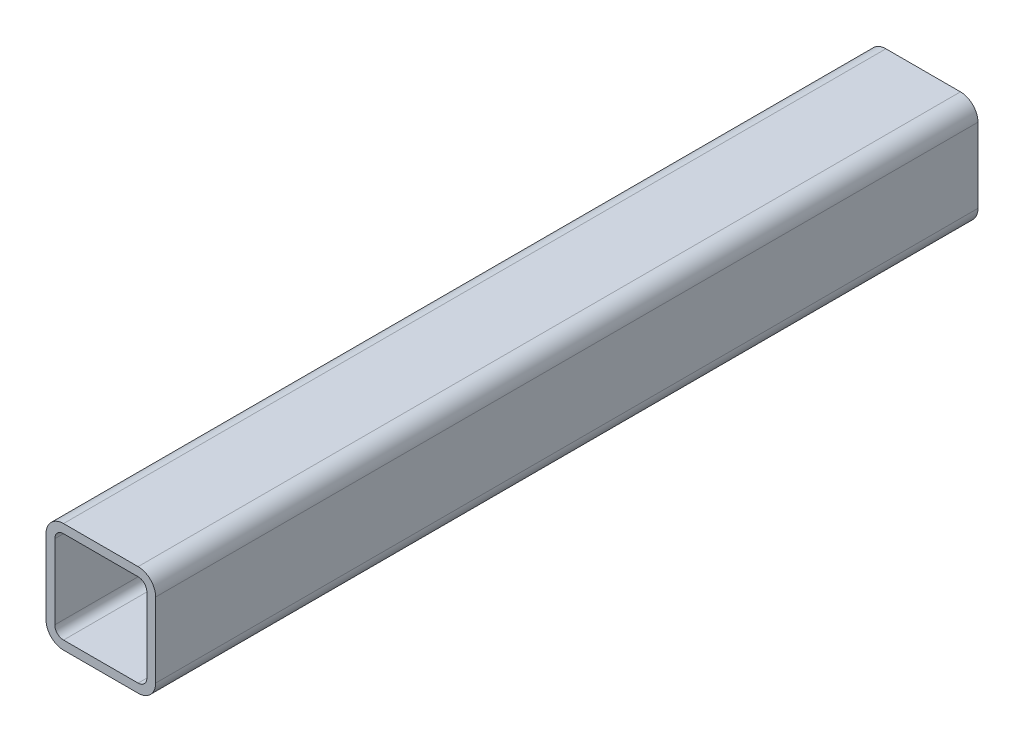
from build123d import *

# Parameters (mm, degrees)
EXTRUDE_THIN1_DEPTH = 375


with BuildPart() as part:
    # Sketch2 → Extrude-Thin1 (new, symmetric)
    with BuildSketch(Plane.XY):
        with BuildLine():
            Line((-50, -34), (-50, 34))
            ThreePointArc((-50, 34), (-45.313708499, 45.313708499), (-34, 50))
            Line((-34, 50), (34, 50))
            ThreePointArc((34, 50), (45.313708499, 45.313708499), (50, 34))
            Line((50, 34), (50, -34))
            ThreePointArc((50, -34), (45.313708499, -45.313708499), (34, -50))
            Line((34, -50), (-34, -50))
            ThreePointArc((-34, -50), (-45.313708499, -45.313708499), (-50, -34))
        make_face()
        with BuildLine():
            Line((-42, -34), (-42, 34))
            ThreePointArc((-42, 34), (-39.656854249, 39.656854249), (-34, 42))
            Line((-34, 42), (34, 42))
            ThreePointArc((34, 42), (39.656854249, 39.656854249), (42, 34))
            Line((42, 34), (42, -34))
            ThreePointArc((42, -34), (39.656854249, -39.656854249), (34, -42))
            Line((34, -42), (-34, -42))
            ThreePointArc((-34, -42), (-39.656854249, -39.656854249), (-42, -34))
        make_face(mode=Mode.SUBTRACT)
    extrude(amount=EXTRUDE_THIN1_DEPTH, both=True)


solid = part.part
